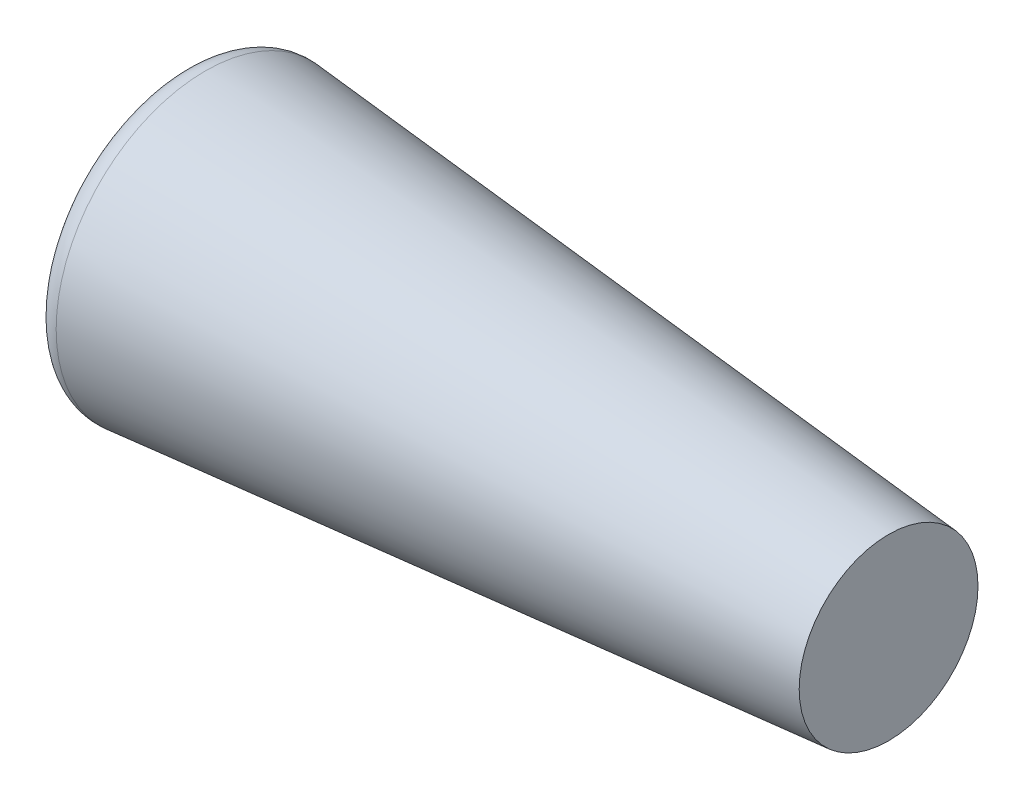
from build123d import *

# Parameters (mm, degrees)
FILLET2_R = 0.2


with BuildPart() as part:
    # Sketch1 → Revolve1 (revolve)
    with BuildSketch(Plane.XY, mode=Mode.PRIVATE) as revolve1_sk:
        Polygon((0, 0), (7, 0), (7, 0.887579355), (0, 1.5), align=None)
    revolve(revolve1_sk.sketch.rotate(Axis((0, 0, 0), (1, 0, 0)), 90), axis=Axis((0, 0, 0), (1, 0, 0)))

    # Fillet2
    fillet2_edges = [part.edges().sort_by_distance(p)[0] for p in [
        (0, 0, -1.5),
    ]]
    fillet(fillet2_edges, radius=FILLET2_R)


solid = part.part
